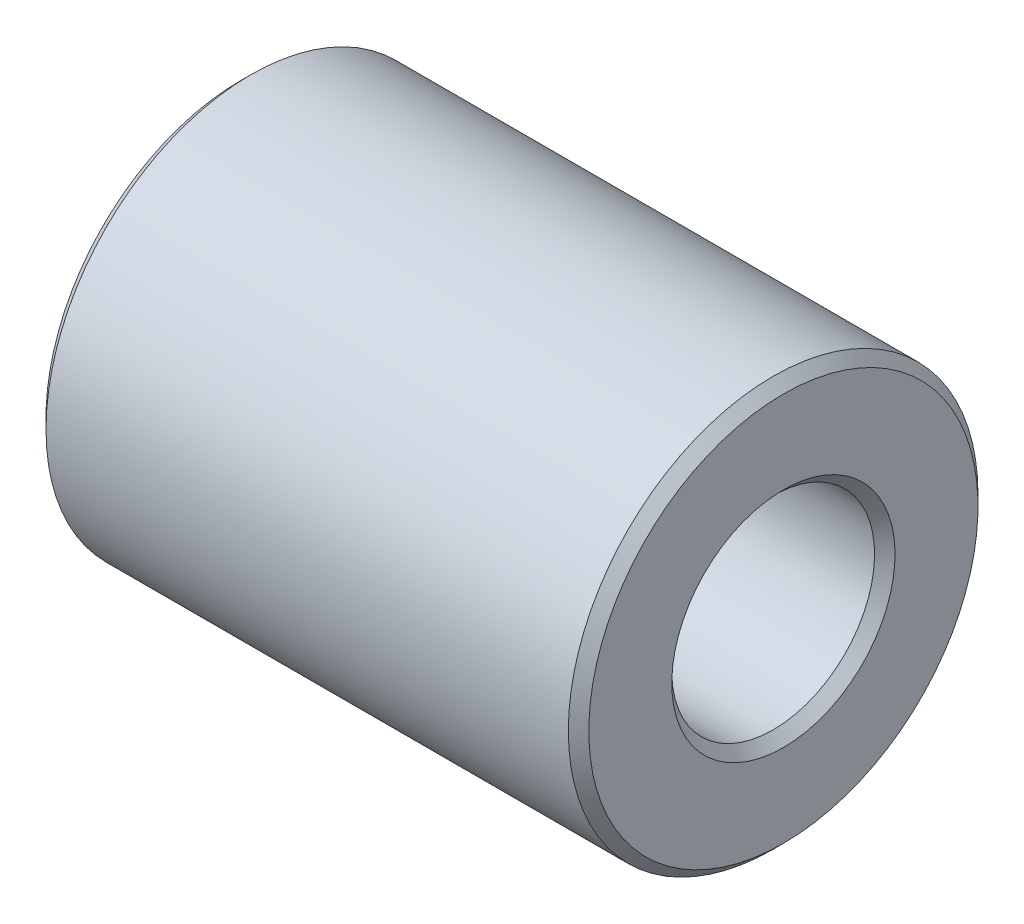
from build123d import *


with BuildPart() as part:
    # Esquisse1 → R_volution1 (revolve)
    with BuildSketch(Plane.XY, mode=Mode.PRIVATE) as r_volution1_sk:
        Polygon((0, 9.5), (0, 5.45), (0.5, 4.95), (26, 4.95), (26.5, 5.45), (26.5, 9.5), (26, 10), (0.5, 10), align=None)
    revolve(r_volution1_sk.sketch.rotate(Axis((36.83848953, 0, 0), (-1, 0, 0)), 180), axis=Axis((36.83848953, 0, 0), (-1, 0, 0)))


solid = part.part
